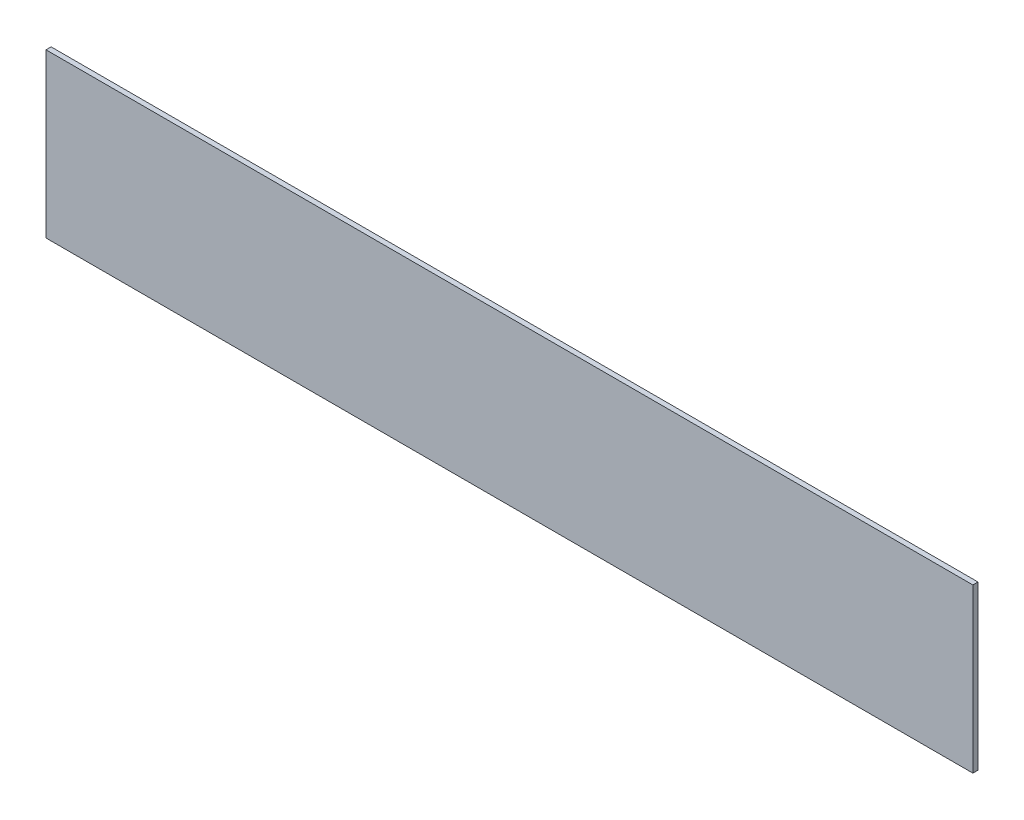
from build123d import *

# Parameters (mm, degrees)
SKETCH1_W      = 72.5
SKETCH1_H      = 12.75
F_3M_VHB_DEPTH = 0.4


with BuildPart() as part:
    # Sketch1 → 3M VHB (new body)
    with BuildSketch(Plane.XY):
        Rectangle(SKETCH1_W, SKETCH1_H)
    extrude(amount=F_3M_VHB_DEPTH)


solid = part.part
